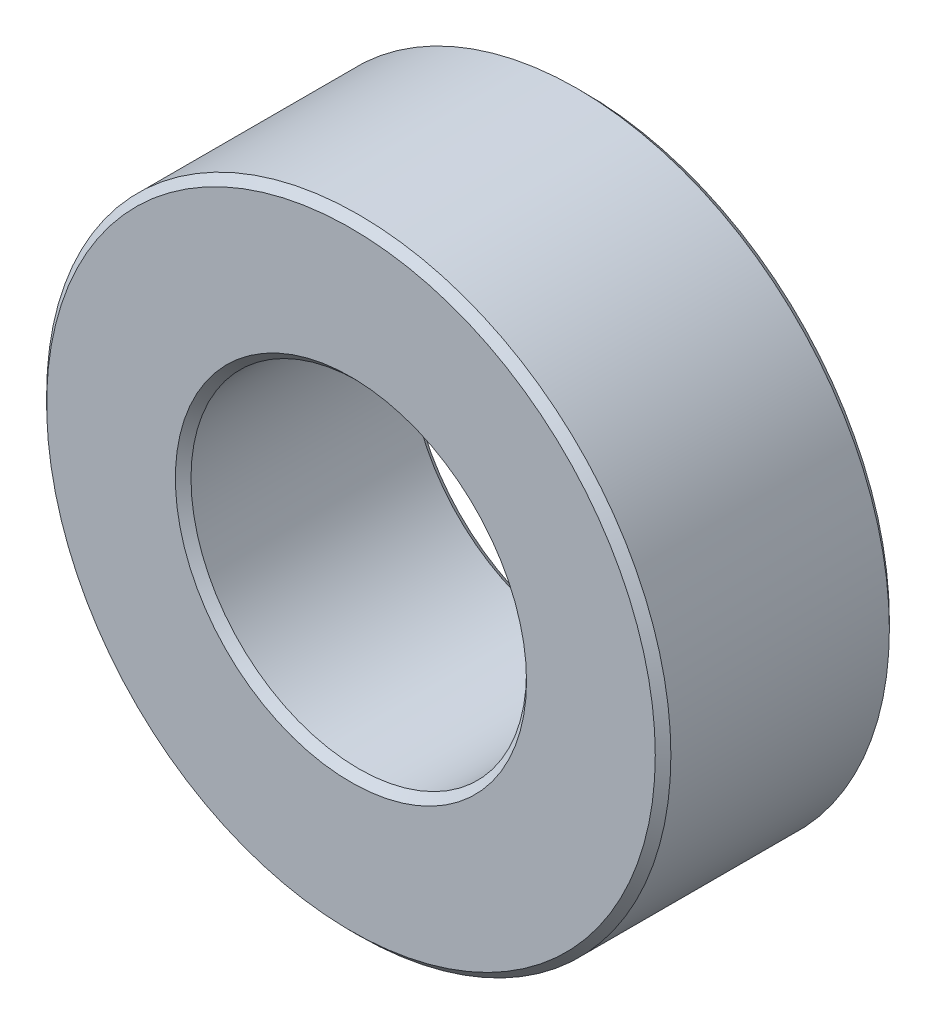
from build123d import *

# Parameters (mm, degrees)
SKETCH1_R           = 4
SKETCH1_R_2         = 2.15
BOSS_EXTRUDE2_DEPTH = 1.5
CHAMFER3_SIZE       = 0.1


with BuildPart() as part:
    # Sketch1 → Boss-Extrude2 (new, symmetric)
    with BuildSketch(Plane.XY):
        Circle(SKETCH1_R)
        Circle(SKETCH1_R_2, mode=Mode.SUBTRACT)
    extrude(amount=BOSS_EXTRUDE2_DEPTH, both=True)

    # Chamfer3
    chamfer3_edges = [part.edges().sort_by_distance(p)[0] for p in [
        (-4, 0, -1.5),
        (-4, 0, 1.5),
        (-2.15, 0, -1.5),
        (-2.15, 0, 1.5),
    ]]
    chamfer(chamfer3_edges, length=CHAMFER3_SIZE)


solid = part.part
